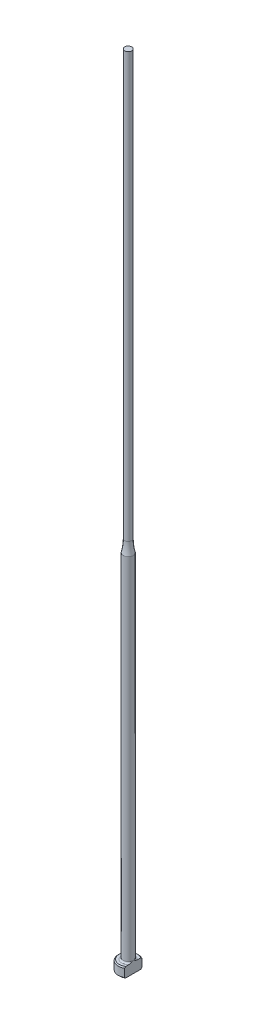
from build123d import *
from build123d.topology import SkipClean

# Parameters (mm, degrees)
CHAMFER1_SIZE = 0.2
FILLET1_R     = 0.3
KEY_DEPTH     = 161.024998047


with BuildPart() as part:
    # Sketch1 → Revolve1 (revolve)
    with BuildSketch(Plane.XY, mode=Mode.PRIVATE) as revolve1_sk:
        with BuildLine():
            Line((0, 0), (-2, 0))
            Line((-2, 0), (-2, 2))
            Line((-2, 2), (-1, 2))
            Line((-1, 2), (-1, 72.568950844))
            ThreePointArc((-1, 72.568950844), (-0.775283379, 73.775255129), (-0.7, 75))
            Line((-0.7, 75), (-0.7, 160))
            Line((-0.7, 160), (0, 160))
            Line((0, 160), (0, 0))
        make_face()
    revolve(revolve1_sk.sketch.rotate(Axis((0, 259.958771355, 0), (0, -1, 0)), 270), axis=Axis((0, 259.958771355, 0), (0, -1, 0)))

    # Chamfer1
    chamfer1_edges = [part.edges().sort_by_distance(p)[0] for p in [
        (0, 0, -2),
        (0, 2, -2),
    ]]
    chamfer(chamfer1_edges, length=CHAMFER1_SIZE)

    # Fillet1
    fillet1_edges = [part.edges().sort_by_distance(p)[0] for p in [
        (0, 2, -1),
    ]]
    fillet(fillet1_edges, radius=FILLET1_R)

    # Sketch2 → KEY (cut, through all)
    with SkipClean():  # the faces are left unmerged after this step: merging them gives an invalid solid
        with BuildSketch(Plane(origin=(0, 0, 0), x_dir=(1, 0, 0), z_dir=(0, 1, 0))):
            with BuildLine():
                Line((1, 1.732050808), (1, -1.732050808))
                ThreePointArc((1, -1.732050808), (2, 0), (1, 1.732050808))
            make_face()
        extrude(amount=KEY_DEPTH, mode=Mode.SUBTRACT)


solid = part.part
